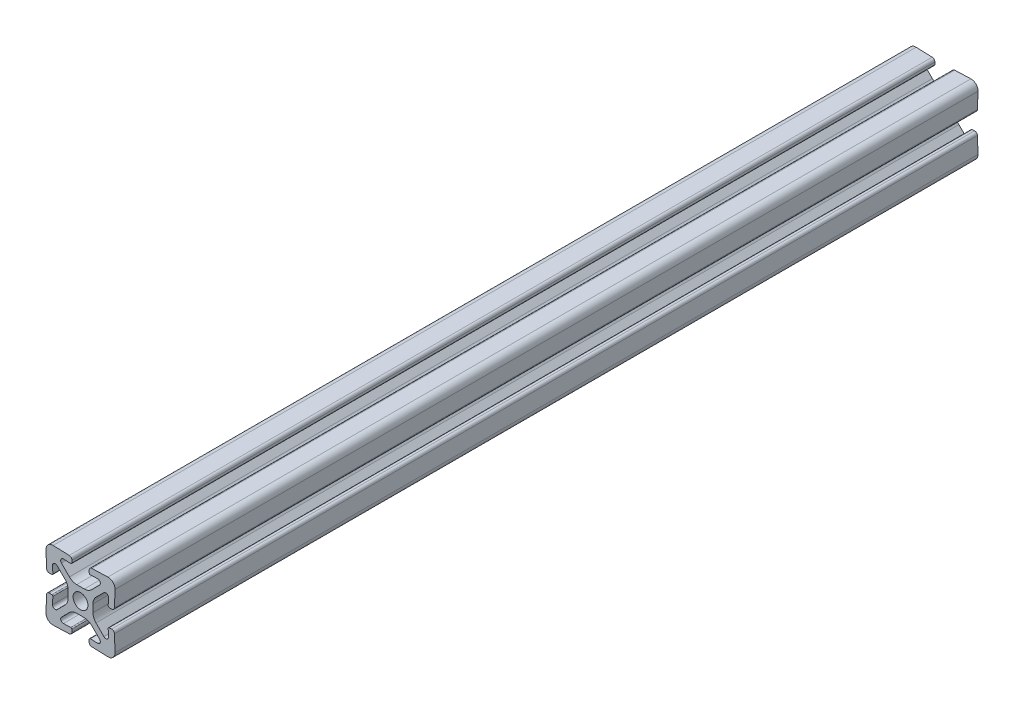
from build123d import *

# Parameters (mm, degrees)
BOSS_EXTRUDE1_DEPTH = 125
CIRPATTERN1_COUNT   = 4


with BuildPart() as part:
    # Sketch3 → Boss-Extrude1 (new, symmetric)
    with BuildSketch(Plane.XY):
        with BuildLine():
            Line((-2.524916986, 8.30911066), (-2.500487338, 9.008684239))
            ThreePointArc((-2.500487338, 9.008684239), (-2.714917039, 9.582202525), (-3.272080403, 9.836116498))
            Line((-3.272080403, 9.836116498), (-7.930201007, 9.998781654))
            ThreePointArc((-7.930201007, 9.998781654), (-9.414213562, 9.414213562), (-9.998781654, 7.930201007))
            Line((-9.998781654, 7.930201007), (-9.836116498, 3.272080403))
            ThreePointArc((-9.836116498, 3.272080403), (-9.582202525, 2.714917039), (-9.008684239, 2.500487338))
            Line((-9.008684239, 2.500487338), (-8.30911066, 2.524916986))
            ThreePointArc((-8.30911066, 2.524916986), (-8.100174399, 2.620134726), (-8.019763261, 2.835204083))
            Line((-8.019763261, 2.835204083), (-8.093719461, 4.953032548))
            ThreePointArc((-8.093719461, 4.953032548), (-7.631170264, 5.686128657), (-6.779559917, 5.52444538))
            Line((-6.779559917, 5.52444538), (-4.478679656, 3.22356512))
            ThreePointArc((-4.478679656, 3.22356512), (-3.828361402, 2.250295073), (-3.6, 1.102244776))
            Line((-3.6, 1.102244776), (-3.6, 0))
            Line((-3.6, 0), (-2.15, 0))
            ThreePointArc((-2.15, 0), (-1.52027958, 1.52027958), (0, 2.15))
            Line((0, 2.15), (0, 3.6))
            Line((0, 3.6), (-1.102244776, 3.6))
            ThreePointArc((-1.102244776, 3.6), (-2.250295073, 3.828361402), (-3.22356512, 4.478679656))
            Line((-3.22356512, 4.478679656), (-5.52444538, 6.779559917))
            ThreePointArc((-5.52444538, 6.779559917), (-5.686128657, 7.631170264), (-4.953032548, 8.093719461))
            Line((-4.953032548, 8.093719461), (-2.835204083, 8.019763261))
            ThreePointArc((-2.835204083, 8.019763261), (-2.620134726, 8.100174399), (-2.524916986, 8.30911066))
        make_face()
    boss_extrude1 = extrude(amount=BOSS_EXTRUDE1_DEPTH, both=True)

    # CirPattern1: Boss-Extrude1 ×4 about axis
    cirpattern1_axis = Axis((0, 0, 0), (0, 0, 1))
    for i in range(1, CIRPATTERN1_COUNT):
        add(boss_extrude1.rotate(cirpattern1_axis, i * 360 / CIRPATTERN1_COUNT))


solid = part.part
